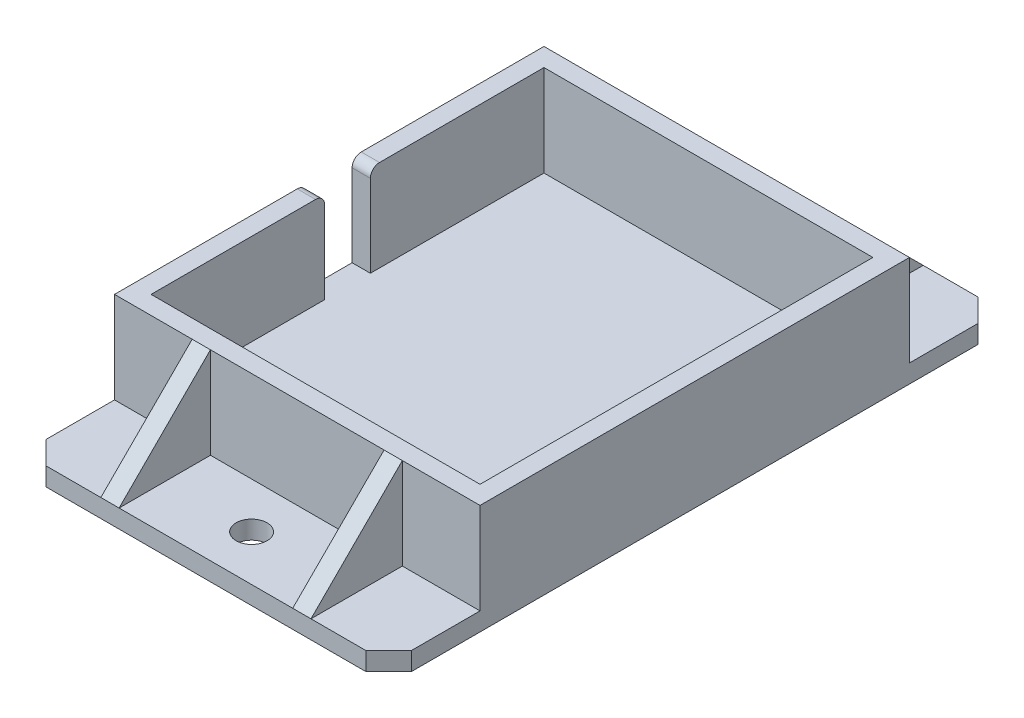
ISO-10303-21;
HEADER;
FILE_DESCRIPTION(('STEP AP214'),'2;1');
FILE_NAME('part.step','',(''),(''),'','','');
FILE_SCHEMA(('AUTOMOTIVE_DESIGN { 1 0 10303 214 1 1 1 1 }'));
ENDSEC;
DATA;
#1=APPLICATION_CONTEXT('core data for automotive mechanical design processes');
#2=APPLICATION_PROTOCOL_DEFINITION('international standard','automotive_design',2000,#1);
#3=PRODUCT_CONTEXT('',#1,'mechanical');
#4=PRODUCT('Part','Part','',(#3));
#5=PRODUCT_RELATED_PRODUCT_CATEGORY('part','',(#4));
#6=PRODUCT_DEFINITION_FORMATION('','',#4);
#7=PRODUCT_DEFINITION_CONTEXT('part definition',#1,'design');
#8=PRODUCT_DEFINITION('design','',#6,#7);
#9=PRODUCT_DEFINITION_SHAPE('','',#8);
#10=(LENGTH_UNIT() NAMED_UNIT(*) SI_UNIT(.MILLI.,.METRE.));
#11=(NAMED_UNIT(*) PLANE_ANGLE_UNIT() SI_UNIT($,.RADIAN.));
#12=(NAMED_UNIT(*) SI_UNIT($,.STERADIAN.) SOLID_ANGLE_UNIT());
#13=UNCERTAINTY_MEASURE_WITH_UNIT(LENGTH_MEASURE(1.E-05),#10,'distance_accuracy_value','');
#14=(GEOMETRIC_REPRESENTATION_CONTEXT(3) GLOBAL_UNCERTAINTY_ASSIGNED_CONTEXT((#13)) GLOBAL_UNIT_ASSIGNED_CONTEXT((#10,
#11,#12)) REPRESENTATION_CONTEXT('',''));
#15=CARTESIAN_POINT('',(0.,0.,0.));
#16=DIRECTION('',(0.,0.,1.));
#17=DIRECTION('',(1.,0.,0.));
#18=AXIS2_PLACEMENT_3D('',#15,#16,#17);
#19=CARTESIAN_POINT('',(-40.,20.,47.));
#20=DIRECTION('',(0.,0.,-1.));
#21=DIRECTION('',(-1.,0.,0.));
#22=AXIS2_PLACEMENT_3D('',#19,#20,#21);
#23=PLANE('',#22);
#24=DIRECTION('',(0.,-1.,0.));
#25=VECTOR('',#24,1.);
#26=CARTESIAN_POINT('',(19.,20.,47.));
#27=LINE('',#26,#25);
#28=CARTESIAN_POINT('',(19.,20.,47.));
#29=VERTEX_POINT('',#28);
#30=CARTESIAN_POINT('',(19.,0.,47.));
#31=VERTEX_POINT('',#30);
#32=EDGE_CURVE('E279',#29,#31,#27,.T.);
#33=ORIENTED_EDGE('',*,*,#32,.F.);
#34=DIRECTION('',(1.,0.,0.));
#35=VECTOR('',#34,1.);
#36=CARTESIAN_POINT('',(-40.,20.,47.));
#37=LINE('',#36,#35);
#38=CARTESIAN_POINT('',(-19.,20.,47.));
#39=VERTEX_POINT('',#38);
#40=EDGE_CURVE('E289',#39,#29,#37,.T.);
#41=ORIENTED_EDGE('',*,*,#40,.F.);
#42=DIRECTION('',(0.,1.,0.));
#43=VECTOR('',#42,1.);
#44=CARTESIAN_POINT('',(-19.,20.,47.));
#45=LINE('',#44,#43);
#46=CARTESIAN_POINT('',(-19.,0.,47.));
#47=VERTEX_POINT('',#46);
#48=EDGE_CURVE('E701',#47,#39,#45,.T.);
#49=ORIENTED_EDGE('',*,*,#48,.F.);
#50=DIRECTION('',(1.,0.,0.));
#51=VECTOR('',#50,1.);
#52=CARTESIAN_POINT('',(-40.,0.,47.));
#53=LINE('',#52,#51);
#54=EDGE_CURVE('E292',#47,#31,#53,.T.);
#55=ORIENTED_EDGE('',*,*,#54,.T.);
#56=EDGE_LOOP('',(#33,#41,#49,#55));
#57=FACE_BOUND('',#56,.T.);
#58=ADVANCED_FACE('F39',(#57),#23,.F.);
#59=CARTESIAN_POINT('',(0.,0.,0.));
#60=DIRECTION('',(0.,1.,0.));
#61=DIRECTION('',(0.,0.,1.));
#62=AXIS2_PLACEMENT_3D('',#59,#60,#61);
#63=PLANE('',#62);
#64=CARTESIAN_POINT('',(0.,0.,57.));
#65=DIRECTION('',(0.,1.,0.));
#66=DIRECTION('',(0.,0.,1.));
#67=AXIS2_PLACEMENT_3D('',#64,#65,#66);
#68=CIRCLE('',#67,3.4);
#69=CARTESIAN_POINT('',(0.,0.,60.4));
#70=VERTEX_POINT('',#69);
#71=EDGE_CURVE('E596',#70,#70,#68,.T.);
#72=ORIENTED_EDGE('',*,*,#71,.F.);
#73=EDGE_LOOP('',(#72));
#74=FACE_BOUND('',#73,.T.);
#75=DIRECTION('',(-1.,0.,0.));
#76=VECTOR('',#75,1.);
#77=CARTESIAN_POINT('',(-40.,0.,67.));
#78=LINE('',#77,#76);
#79=CARTESIAN_POINT('',(19.,0.,67.));
#80=VERTEX_POINT('',#79);
#81=CARTESIAN_POINT('',(-19.,0.,67.));
#82=VERTEX_POINT('',#81);
#83=EDGE_CURVE('E465',#80,#82,#78,.T.);
#84=ORIENTED_EDGE('',*,*,#83,.F.);
#85=DIRECTION('',(0.,0.,-1.));
#86=VECTOR('',#85,1.);
#87=CARTESIAN_POINT('',(19.,0.,0.));
#88=LINE('',#87,#86);
#89=EDGE_CURVE('E281',#80,#31,#88,.T.);
#90=ORIENTED_EDGE('',*,*,#89,.T.);
#91=ORIENTED_EDGE('',*,*,#54,.F.);
#92=DIRECTION('',(0.,0.,1.));
#93=VECTOR('',#92,1.);
#94=CARTESIAN_POINT('',(-19.,0.,0.));
#95=LINE('',#94,#93);
#96=EDGE_CURVE('E706',#47,#82,#95,.T.);
#97=ORIENTED_EDGE('',*,*,#96,.T.);
#98=EDGE_LOOP('',(#84,#90,#91,#97));
#99=FACE_BOUND('',#98,.T.);
#100=ADVANCED_FACE('F668',(#74,#99),#63,.T.);
#101=CARTESIAN_POINT('',(23.,20.,47.));
#102=VERTEX_POINT('',#101);
#103=CARTESIAN_POINT('',(40.,20.,47.));
#104=VERTEX_POINT('',#103);
#105=EDGE_CURVE('E302',#102,#104,#37,.T.);
#106=ORIENTED_EDGE('',*,*,#105,.F.);
#107=DIRECTION('',(0.,-1.,0.));
#108=VECTOR('',#107,1.);
#109=CARTESIAN_POINT('',(23.,20.,47.));
#110=LINE('',#109,#108);
#111=CARTESIAN_POINT('',(23.,0.,47.));
#112=VERTEX_POINT('',#111);
#113=EDGE_CURVE('E274',#102,#112,#110,.T.);
#114=ORIENTED_EDGE('',*,*,#113,.T.);
#115=CARTESIAN_POINT('',(40.,0.,47.));
#116=VERTEX_POINT('',#115);
#117=EDGE_CURVE('E325',#112,#116,#53,.T.);
#118=ORIENTED_EDGE('',*,*,#117,.T.);
#119=DIRECTION('',(0.,-1.,0.));
#120=VECTOR('',#119,1.);
#121=CARTESIAN_POINT('',(40.,20.,47.));
#122=LINE('',#121,#120);
#123=EDGE_CURVE('E339',#104,#116,#122,.T.);
#124=ORIENTED_EDGE('',*,*,#123,.F.);
#125=EDGE_LOOP('',(#106,#114,#118,#124));
#126=FACE_BOUND('',#125,.T.);
#127=ADVANCED_FACE('F670',(#126),#23,.F.);
#128=CARTESIAN_POINT('',(35.,0.,67.));
#129=VERTEX_POINT('',#128);
#130=CARTESIAN_POINT('',(23.,0.,67.));
#131=VERTEX_POINT('',#130);
#132=EDGE_CURVE('E461',#129,#131,#78,.T.);
#133=ORIENTED_EDGE('',*,*,#132,.F.);
#134=DIRECTION('',(-0.707106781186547,0.,0.707106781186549));
#135=VECTOR('',#134,1.);
#136=CARTESIAN_POINT('',(51.0000000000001,0.,50.9999999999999));
#137=LINE('',#136,#135);
#138=CARTESIAN_POINT('',(40.,0.,62.));
#139=VERTEX_POINT('',#138);
#140=EDGE_CURVE('E380',#129,#139,#137,.F.);
#141=ORIENTED_EDGE('',*,*,#140,.T.);
#142=DIRECTION('',(0.,0.,1.));
#143=VECTOR('',#142,1.);
#144=CARTESIAN_POINT('',(40.,0.,-67.));
#145=LINE('',#144,#143);
#146=EDGE_CURVE('E451',#116,#139,#145,.T.);
#147=ORIENTED_EDGE('',*,*,#146,.F.);
#148=ORIENTED_EDGE('',*,*,#117,.F.);
#149=DIRECTION('',(0.,0.,-1.));
#150=VECTOR('',#149,1.);
#151=CARTESIAN_POINT('',(23.,0.,0.));
#152=LINE('',#151,#150);
#153=EDGE_CURVE('E294',#131,#112,#152,.T.);
#154=ORIENTED_EDGE('',*,*,#153,.F.);
#155=EDGE_LOOP('',(#133,#141,#147,#148,#154));
#156=FACE_BOUND('',#155,.T.);
#157=ADVANCED_FACE('F677',(#156),#63,.T.);
#158=CARTESIAN_POINT('',(-40.,20.,-47.));
#159=DIRECTION('',(0.,0.,1.));
#160=DIRECTION('',(1.,0.,0.));
#161=AXIS2_PLACEMENT_3D('',#158,#159,#160);
#162=PLANE('',#161);
#163=DIRECTION('',(0.,1.,0.));
#164=VECTOR('',#163,1.);
#165=CARTESIAN_POINT('',(19.,20.,-47.));
#166=LINE('',#165,#164);
#167=CARTESIAN_POINT('',(19.,0.,-47.));
#168=VERTEX_POINT('',#167);
#169=CARTESIAN_POINT('',(19.,20.,-47.));
#170=VERTEX_POINT('',#169);
#171=EDGE_CURVE('E724',#168,#170,#166,.T.);
#172=ORIENTED_EDGE('',*,*,#171,.F.);
#173=DIRECTION('',(-1.,0.,0.));
#174=VECTOR('',#173,1.);
#175=CARTESIAN_POINT('',(-40.,0.,-47.));
#176=LINE('',#175,#174);
#177=CARTESIAN_POINT('',(-19.,0.,-47.));
#178=VERTEX_POINT('',#177);
#179=EDGE_CURVE('E331',#168,#178,#176,.T.);
#180=ORIENTED_EDGE('',*,*,#179,.T.);
#181=DIRECTION('',(0.,-1.,0.));
#182=VECTOR('',#181,1.);
#183=CARTESIAN_POINT('',(-19.,20.,-47.));
#184=LINE('',#183,#182);
#185=CARTESIAN_POINT('',(-19.,20.,-47.));
#186=VERTEX_POINT('',#185);
#187=EDGE_CURVE('E583',#186,#178,#184,.T.);
#188=ORIENTED_EDGE('',*,*,#187,.F.);
#189=DIRECTION('',(-1.,0.,0.));
#190=VECTOR('',#189,1.);
#191=CARTESIAN_POINT('',(-40.,20.,-47.));
#192=LINE('',#191,#190);
#193=EDGE_CURVE('E319',#170,#186,#192,.T.);
#194=ORIENTED_EDGE('',*,*,#193,.F.);
#195=EDGE_LOOP('',(#172,#180,#188,#194));
#196=FACE_BOUND('',#195,.T.);
#197=ADVANCED_FACE('F761',(#196),#162,.F.);
#198=CARTESIAN_POINT('',(0.,0.,-57.));
#199=DIRECTION('',(0.,1.,0.));
#200=DIRECTION('',(0.,0.,1.));
#201=AXIS2_PLACEMENT_3D('',#198,#199,#200);
#202=CIRCLE('',#201,3.4);
#203=CARTESIAN_POINT('',(0.,0.,-53.6));
#204=VERTEX_POINT('',#203);
#205=EDGE_CURVE('E604',#204,#204,#202,.T.);
#206=ORIENTED_EDGE('',*,*,#205,.F.);
#207=EDGE_LOOP('',(#206));
#208=FACE_BOUND('',#207,.T.);
#209=ORIENTED_EDGE('',*,*,#179,.F.);
#210=DIRECTION('',(0.,0.,-1.));
#211=VECTOR('',#210,1.);
#212=CARTESIAN_POINT('',(19.,0.,0.));
#213=LINE('',#212,#211);
#214=CARTESIAN_POINT('',(19.,0.,-67.));
#215=VERTEX_POINT('',#214);
#216=EDGE_CURVE('E717',#168,#215,#213,.T.);
#217=ORIENTED_EDGE('',*,*,#216,.T.);
#218=DIRECTION('',(1.,0.,0.));
#219=VECTOR('',#218,1.);
#220=CARTESIAN_POINT('',(-40.,0.,-67.));
#221=LINE('',#220,#219);
#222=CARTESIAN_POINT('',(-19.,0.,-67.));
#223=VERTEX_POINT('',#222);
#224=EDGE_CURVE('E754',#223,#215,#221,.T.);
#225=ORIENTED_EDGE('',*,*,#224,.F.);
#226=DIRECTION('',(0.,0.,1.));
#227=VECTOR('',#226,1.);
#228=CARTESIAN_POINT('',(-19.,0.,0.));
#229=LINE('',#228,#227);
#230=EDGE_CURVE('E590',#223,#178,#229,.T.);
#231=ORIENTED_EDGE('',*,*,#230,.T.);
#232=EDGE_LOOP('',(#209,#217,#225,#231));
#233=FACE_BOUND('',#232,.T.);
#234=ADVANCED_FACE('F752',(#208,#233),#63,.T.);
#235=CARTESIAN_POINT('',(40.,0.,-47.));
#236=VERTEX_POINT('',#235);
#237=CARTESIAN_POINT('',(23.,0.,-47.));
#238=VERTEX_POINT('',#237);
#239=EDGE_CURVE('E326',#236,#238,#176,.T.);
#240=ORIENTED_EDGE('',*,*,#239,.T.);
#241=DIRECTION('',(0.,1.,0.));
#242=VECTOR('',#241,1.);
#243=CARTESIAN_POINT('',(23.,20.,-47.));
#244=LINE('',#243,#242);
#245=CARTESIAN_POINT('',(23.,20.,-47.));
#246=VERTEX_POINT('',#245);
#247=EDGE_CURVE('E731',#238,#246,#244,.T.);
#248=ORIENTED_EDGE('',*,*,#247,.T.);
#249=CARTESIAN_POINT('',(40.,20.,-47.));
#250=VERTEX_POINT('',#249);
#251=EDGE_CURVE('E314',#250,#246,#192,.T.);
#252=ORIENTED_EDGE('',*,*,#251,.F.);
#253=DIRECTION('',(0.,-1.,0.));
#254=VECTOR('',#253,1.);
#255=CARTESIAN_POINT('',(40.,20.,-47.));
#256=LINE('',#255,#254);
#257=EDGE_CURVE('E335',#250,#236,#256,.T.);
#258=ORIENTED_EDGE('',*,*,#257,.T.);
#259=EDGE_LOOP('',(#240,#248,#252,#258));
#260=FACE_BOUND('',#259,.T.);
#261=ADVANCED_FACE('F812',(#260),#162,.F.);
#262=CARTESIAN_POINT('',(40.,0.,-62.));
#263=VERTEX_POINT('',#262);
#264=EDGE_CURVE('E444',#263,#236,#145,.T.);
#265=ORIENTED_EDGE('',*,*,#264,.F.);
#266=DIRECTION('',(0.707106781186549,0.,0.707106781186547));
#267=VECTOR('',#266,1.);
#268=CARTESIAN_POINT('',(51.,0.,-51.0000000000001));
#269=LINE('',#268,#267);
#270=CARTESIAN_POINT('',(35.,0.,-67.));
#271=VERTEX_POINT('',#270);
#272=EDGE_CURVE('E61',#263,#271,#269,.F.);
#273=ORIENTED_EDGE('',*,*,#272,.T.);
#274=CARTESIAN_POINT('',(23.,0.,-67.));
#275=VERTEX_POINT('',#274);
#276=EDGE_CURVE('E424',#275,#271,#221,.T.);
#277=ORIENTED_EDGE('',*,*,#276,.F.);
#278=DIRECTION('',(0.,0.,-1.));
#279=VECTOR('',#278,1.);
#280=CARTESIAN_POINT('',(23.,0.,0.));
#281=LINE('',#280,#279);
#282=EDGE_CURVE('E727',#238,#275,#281,.T.);
#283=ORIENTED_EDGE('',*,*,#282,.F.);
#284=ORIENTED_EDGE('',*,*,#239,.F.);
#285=EDGE_LOOP('',(#265,#273,#277,#283,#284));
#286=FACE_BOUND('',#285,.T.);
#287=ADVANCED_FACE('F447',(#286),#63,.T.);
#288=CARTESIAN_POINT('',(-36.,20.,-43.));
#289=DIRECTION('',(1.,0.,0.));
#290=DIRECTION('',(0.,0.,-1.));
#291=AXIS2_PLACEMENT_3D('',#288,#289,#290);
#292=PLANE('',#291);
#293=DIRECTION('',(0.,0.,1.));
#294=VECTOR('',#293,1.);
#295=CARTESIAN_POINT('',(-36.,20.,-43.));
#296=LINE('',#295,#294);
#297=CARTESIAN_POINT('',(-36.,20.,-43.));
#298=VERTEX_POINT('',#297);
#299=CARTESIAN_POINT('',(-36.,20.,-6.99999999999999));
#300=VERTEX_POINT('',#299);
#301=EDGE_CURVE('E481',#298,#300,#296,.T.);
#302=ORIENTED_EDGE('',*,*,#301,.T.);
#303=CARTESIAN_POINT('',(-36.,18.,-6.99999999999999));
#304=DIRECTION('',(1.,0.,0.));
#305=DIRECTION('',(0.,0.,-1.));
#306=AXIS2_PLACEMENT_3D('',#303,#304,#305);
#307=CIRCLE('',#306,2.);
#308=CARTESIAN_POINT('',(-36.,18.,-4.99999999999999));
#309=VERTEX_POINT('',#308);
#310=EDGE_CURVE('E364',#300,#309,#307,.T.);
#311=ORIENTED_EDGE('',*,*,#310,.T.);
#312=DIRECTION('',(0.,-1.,0.));
#313=VECTOR('',#312,1.);
#314=CARTESIAN_POINT('',(-36.,0.,-4.99999999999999));
#315=LINE('',#314,#313);
#316=CARTESIAN_POINT('',(-36.,0.,-4.99999999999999));
#317=VERTEX_POINT('',#316);
#318=EDGE_CURVE('E459',#309,#317,#315,.T.);
#319=ORIENTED_EDGE('',*,*,#318,.T.);
#320=DIRECTION('',(0.,0.,1.));
#321=VECTOR('',#320,1.);
#322=CARTESIAN_POINT('',(-36.,0.,-43.));
#323=LINE('',#322,#321);
#324=CARTESIAN_POINT('',(-36.,0.,-43.));
#325=VERTEX_POINT('',#324);
#326=EDGE_CURVE('E496',#325,#317,#323,.T.);
#327=ORIENTED_EDGE('',*,*,#326,.F.);
#328=DIRECTION('',(0.,-1.,0.));
#329=VECTOR('',#328,1.);
#330=CARTESIAN_POINT('',(-36.,20.,-43.));
#331=LINE('',#330,#329);
#332=EDGE_CURVE('E509',#298,#325,#331,.T.);
#333=ORIENTED_EDGE('',*,*,#332,.F.);
#334=EDGE_LOOP('',(#302,#311,#319,#327,#333));
#335=FACE_BOUND('',#334,.T.);
#336=ADVANCED_FACE('F543',(#335),#292,.T.);
#337=CARTESIAN_POINT('',(0.,20.,0.));
#338=DIRECTION('',(0.,1.,0.));
#339=DIRECTION('',(0.,0.,1.));
#340=AXIS2_PLACEMENT_3D('',#337,#338,#339);
#341=PLANE('',#340);
#342=DIRECTION('',(0.,0.,-1.));
#343=VECTOR('',#342,1.);
#344=CARTESIAN_POINT('',(36.,20.,-43.));
#345=LINE('',#344,#343);
#346=CARTESIAN_POINT('',(36.,20.,43.));
#347=VERTEX_POINT('',#346);
#348=CARTESIAN_POINT('',(36.,20.,-43.));
#349=VERTEX_POINT('',#348);
#350=EDGE_CURVE('E473',#347,#349,#345,.T.);
#351=ORIENTED_EDGE('',*,*,#350,.F.);
#352=DIRECTION('',(1.,0.,0.));
#353=VECTOR('',#352,1.);
#354=CARTESIAN_POINT('',(-36.,20.,43.));
#355=LINE('',#354,#353);
#356=CARTESIAN_POINT('',(-36.,20.,43.));
#357=VERTEX_POINT('',#356);
#358=EDGE_CURVE('E485',#357,#347,#355,.T.);
#359=ORIENTED_EDGE('',*,*,#358,.F.);
#360=CARTESIAN_POINT('',(-36.,20.,7.00000000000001));
#361=VERTEX_POINT('',#360);
#362=EDGE_CURVE('E480',#361,#357,#296,.T.);
#363=ORIENTED_EDGE('',*,*,#362,.F.);
#364=DIRECTION('',(-1.,0.,0.));
#365=VECTOR('',#364,1.);
#366=CARTESIAN_POINT('',(-40.,20.,7.));
#367=LINE('',#366,#365);
#368=CARTESIAN_POINT('',(-40.,20.,7.00000000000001));
#369=VERTEX_POINT('',#368);
#370=EDGE_CURVE('E357',#361,#369,#367,.T.);
#371=ORIENTED_EDGE('',*,*,#370,.T.);
#372=DIRECTION('',(0.,0.,1.));
#373=VECTOR('',#372,1.);
#374=CARTESIAN_POINT('',(-40.,20.,-47.));
#375=LINE('',#374,#373);
#376=CARTESIAN_POINT('',(-40.,20.,47.));
#377=VERTEX_POINT('',#376);
#378=EDGE_CURVE('E330',#369,#377,#375,.T.);
#379=ORIENTED_EDGE('',*,*,#378,.T.);
#380=CARTESIAN_POINT('',(-23.,20.,47.));
#381=VERTEX_POINT('',#380);
#382=EDGE_CURVE('E301',#377,#381,#37,.T.);
#383=ORIENTED_EDGE('',*,*,#382,.T.);
#384=DIRECTION('',(1.,0.,0.));
#385=VECTOR('',#384,1.);
#386=CARTESIAN_POINT('',(-40.,20.,47.));
#387=LINE('',#386,#385);
#388=EDGE_CURVE('E299',#381,#39,#387,.T.);
#389=ORIENTED_EDGE('',*,*,#388,.T.);
#390=ORIENTED_EDGE('',*,*,#40,.T.);
#391=DIRECTION('',(-1.,0.,0.));
#392=VECTOR('',#391,1.);
#393=CARTESIAN_POINT('',(0.,20.,47.));
#394=LINE('',#393,#392);
#395=EDGE_CURVE('E261',#29,#102,#394,.F.);
#396=ORIENTED_EDGE('',*,*,#395,.T.);
#397=ORIENTED_EDGE('',*,*,#105,.T.);
#398=DIRECTION('',(0.,0.,-1.));
#399=VECTOR('',#398,1.);
#400=CARTESIAN_POINT('',(40.,20.,-47.));
#401=LINE('',#400,#399);
#402=EDGE_CURVE('E306',#104,#250,#401,.T.);
#403=ORIENTED_EDGE('',*,*,#402,.T.);
#404=ORIENTED_EDGE('',*,*,#251,.T.);
#405=DIRECTION('',(-1.,0.,0.));
#406=VECTOR('',#405,1.);
#407=CARTESIAN_POINT('',(0.,20.,-47.));
#408=LINE('',#407,#406);
#409=EDGE_CURVE('E735',#246,#170,#408,.T.);
#410=ORIENTED_EDGE('',*,*,#409,.T.);
#411=ORIENTED_EDGE('',*,*,#193,.T.);
#412=DIRECTION('',(1.,0.,0.));
#413=VECTOR('',#412,1.);
#414=CARTESIAN_POINT('',(-40.,20.,-47.));
#415=LINE('',#414,#413);
#416=CARTESIAN_POINT('',(-23.,20.,-47.));
#417=VERTEX_POINT('',#416);
#418=EDGE_CURVE('E587',#186,#417,#415,.F.);
#419=ORIENTED_EDGE('',*,*,#418,.T.);
#420=CARTESIAN_POINT('',(-40.,20.,-47.));
#421=VERTEX_POINT('',#420);
#422=EDGE_CURVE('E313',#417,#421,#192,.T.);
#423=ORIENTED_EDGE('',*,*,#422,.T.);
#424=CARTESIAN_POINT('',(-40.,20.,-6.99999999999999));
#425=VERTEX_POINT('',#424);
#426=EDGE_CURVE('E307',#421,#425,#375,.T.);
#427=ORIENTED_EDGE('',*,*,#426,.T.);
#428=DIRECTION('',(-1.,0.,0.));
#429=VECTOR('',#428,1.);
#430=CARTESIAN_POINT('',(-36.,20.,-6.99999999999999));
#431=LINE('',#430,#429);
#432=EDGE_CURVE('E361',#425,#300,#431,.F.);
#433=ORIENTED_EDGE('',*,*,#432,.T.);
#434=ORIENTED_EDGE('',*,*,#301,.F.);
#435=DIRECTION('',(-1.,0.,0.));
#436=VECTOR('',#435,1.);
#437=CARTESIAN_POINT('',(-36.,20.,-43.));
#438=LINE('',#437,#436);
#439=EDGE_CURVE('E476',#349,#298,#438,.T.);
#440=ORIENTED_EDGE('',*,*,#439,.F.);
#441=EDGE_LOOP('',(#351,#359,#363,#371,#379,#383,#389,#390,#396,#397,#403,#404,#410,#411,#419,
#423,#427,#433,#434,#440));
#442=FACE_BOUND('',#441,.T.);
#443=ADVANCED_FACE('F297',(#442),#341,.T.);
#444=CARTESIAN_POINT('',(-40.,20.,-47.));
#445=DIRECTION('',(1.,0.,0.));
#446=DIRECTION('',(0.,0.,-1.));
#447=AXIS2_PLACEMENT_3D('',#444,#445,#446);
#448=PLANE('',#447);
#449=DIRECTION('',(0.,0.,-1.));
#450=VECTOR('',#449,1.);
#451=CARTESIAN_POINT('',(-40.,-4.,-67.));
#452=LINE('',#451,#450);
#453=CARTESIAN_POINT('',(-40.,-4.,62.));
#454=VERTEX_POINT('',#453);
#455=CARTESIAN_POINT('',(-40.,-4.,-62.));
#456=VERTEX_POINT('',#455);
#457=EDGE_CURVE('E436',#454,#456,#452,.T.);
#458=ORIENTED_EDGE('',*,*,#457,.F.);
#459=DIRECTION('',(0.,1.,0.));
#460=VECTOR('',#459,1.);
#461=CARTESIAN_POINT('',(-40.,20.,62.));
#462=LINE('',#461,#460);
#463=CARTESIAN_POINT('',(-40.,0.,62.));
#464=VERTEX_POINT('',#463);
#465=EDGE_CURVE('E405',#454,#464,#462,.T.);
#466=ORIENTED_EDGE('',*,*,#465,.T.);
#467=DIRECTION('',(0.,0.,-1.));
#468=VECTOR('',#467,1.);
#469=CARTESIAN_POINT('',(-40.,0.,-67.));
#470=LINE('',#469,#468);
#471=CARTESIAN_POINT('',(-40.,0.,47.));
#472=VERTEX_POINT('',#471);
#473=EDGE_CURVE('E466',#464,#472,#470,.T.);
#474=ORIENTED_EDGE('',*,*,#473,.T.);
#475=DIRECTION('',(0.,-1.,0.));
#476=VECTOR('',#475,1.);
#477=CARTESIAN_POINT('',(-40.,20.,47.));
#478=LINE('',#477,#476);
#479=EDGE_CURVE('E343',#377,#472,#478,.T.);
#480=ORIENTED_EDGE('',*,*,#479,.F.);
#481=ORIENTED_EDGE('',*,*,#378,.F.);
#482=CARTESIAN_POINT('',(-40.,18.,7.));
#483=DIRECTION('',(1.,0.,0.));
#484=DIRECTION('',(0.,0.,-1.));
#485=AXIS2_PLACEMENT_3D('',#482,#483,#484);
#486=CIRCLE('',#485,2.);
#487=CARTESIAN_POINT('',(-40.,18.,5.));
#488=VERTEX_POINT('',#487);
#489=EDGE_CURVE('E351',#369,#488,#486,.F.);
#490=ORIENTED_EDGE('',*,*,#489,.T.);
#491=DIRECTION('',(0.,1.,0.));
#492=VECTOR('',#491,1.);
#493=CARTESIAN_POINT('',(-40.,20.,5.));
#494=LINE('',#493,#492);
#495=CARTESIAN_POINT('',(-40.,0.,5.00000000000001));
#496=VERTEX_POINT('',#495);
#497=EDGE_CURVE('E623',#496,#488,#494,.T.);
#498=ORIENTED_EDGE('',*,*,#497,.F.);
#499=DIRECTION('',(0.,0.,1.));
#500=VECTOR('',#499,1.);
#501=CARTESIAN_POINT('',(-40.,0.,5.00000000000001));
#502=LINE('',#501,#500);
#503=CARTESIAN_POINT('',(-40.,0.,-4.99999999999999));
#504=VERTEX_POINT('',#503);
#505=EDGE_CURVE('E619',#504,#496,#502,.T.);
#506=ORIENTED_EDGE('',*,*,#505,.F.);
#507=DIRECTION('',(0.,-1.,0.));
#508=VECTOR('',#507,1.);
#509=CARTESIAN_POINT('',(-40.,0.,-4.99999999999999));
#510=LINE('',#509,#508);
#511=CARTESIAN_POINT('',(-40.,18.,-4.99999999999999));
#512=VERTEX_POINT('',#511);
#513=EDGE_CURVE('E616',#512,#504,#510,.T.);
#514=ORIENTED_EDGE('',*,*,#513,.F.);
#515=CARTESIAN_POINT('',(-40.,18.,-6.99999999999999));
#516=DIRECTION('',(1.,0.,0.));
#517=DIRECTION('',(0.,0.,-1.));
#518=AXIS2_PLACEMENT_3D('',#515,#516,#517);
#519=CIRCLE('',#518,2.);
#520=EDGE_CURVE('E354',#512,#425,#519,.F.);
#521=ORIENTED_EDGE('',*,*,#520,.T.);
#522=ORIENTED_EDGE('',*,*,#426,.F.);
#523=DIRECTION('',(0.,-1.,0.));
#524=VECTOR('',#523,1.);
#525=CARTESIAN_POINT('',(-40.,20.,-47.));
#526=LINE('',#525,#524);
#527=CARTESIAN_POINT('',(-40.,0.,-47.));
#528=VERTEX_POINT('',#527);
#529=EDGE_CURVE('E318',#421,#528,#526,.T.);
#530=ORIENTED_EDGE('',*,*,#529,.T.);
#531=CARTESIAN_POINT('',(-40.,0.,-62.));
#532=VERTEX_POINT('',#531);
#533=EDGE_CURVE('E464',#528,#532,#470,.T.);
#534=ORIENTED_EDGE('',*,*,#533,.T.);
#535=DIRECTION('',(0.,-1.,0.));
#536=VECTOR('',#535,1.);
#537=CARTESIAN_POINT('',(-40.,20.,-62.));
#538=LINE('',#537,#536);
#539=EDGE_CURVE('E402',#532,#456,#538,.T.);
#540=ORIENTED_EDGE('',*,*,#539,.T.);
#541=EDGE_LOOP('',(#458,#466,#474,#480,#481,#490,#498,#506,#514,#521,#522,#530,#534,#540));
#542=FACE_BOUND('',#541,.T.);
#543=ADVANCED_FACE('F633',(#542),#448,.F.);
#544=CARTESIAN_POINT('',(-23.,0.,47.));
#545=VERTEX_POINT('',#544);
#546=EDGE_CURVE('E320',#472,#545,#53,.T.);
#547=ORIENTED_EDGE('',*,*,#546,.T.);
#548=DIRECTION('',(0.,1.,0.));
#549=VECTOR('',#548,1.);
#550=CARTESIAN_POINT('',(-23.,20.,47.));
#551=LINE('',#550,#549);
#552=EDGE_CURVE('E689',#545,#381,#551,.T.);
#553=ORIENTED_EDGE('',*,*,#552,.T.);
#554=ORIENTED_EDGE('',*,*,#382,.F.);
#555=ORIENTED_EDGE('',*,*,#479,.T.);
#556=EDGE_LOOP('',(#547,#553,#554,#555));
#557=FACE_BOUND('',#556,.T.);
#558=ADVANCED_FACE('F671',(#557),#23,.F.);
#559=CARTESIAN_POINT('',(40.,20.,-47.));
#560=DIRECTION('',(-1.,0.,0.));
#561=DIRECTION('',(0.,0.,1.));
#562=AXIS2_PLACEMENT_3D('',#559,#560,#561);
#563=PLANE('',#562);
#564=ORIENTED_EDGE('',*,*,#146,.T.);
#565=DIRECTION('',(0.,-1.,0.));
#566=VECTOR('',#565,1.);
#567=CARTESIAN_POINT('',(40.,20.,62.));
#568=LINE('',#567,#566);
#569=CARTESIAN_POINT('',(40.,-4.,62.));
#570=VERTEX_POINT('',#569);
#571=EDGE_CURVE('E387',#139,#570,#568,.T.);
#572=ORIENTED_EDGE('',*,*,#571,.T.);
#573=DIRECTION('',(0.,0.,1.));
#574=VECTOR('',#573,1.);
#575=CARTESIAN_POINT('',(40.,-4.,-67.));
#576=LINE('',#575,#574);
#577=CARTESIAN_POINT('',(40.,-4.,-62.));
#578=VERTEX_POINT('',#577);
#579=EDGE_CURVE('E446',#578,#570,#576,.T.);
#580=ORIENTED_EDGE('',*,*,#579,.F.);
#581=DIRECTION('',(0.,1.,0.));
#582=VECTOR('',#581,1.);
#583=CARTESIAN_POINT('',(40.,20.,-62.));
#584=LINE('',#583,#582);
#585=EDGE_CURVE('E383',#578,#263,#584,.T.);
#586=ORIENTED_EDGE('',*,*,#585,.T.);
#587=ORIENTED_EDGE('',*,*,#264,.T.);
#588=ORIENTED_EDGE('',*,*,#257,.F.);
#589=ORIENTED_EDGE('',*,*,#402,.F.);
#590=ORIENTED_EDGE('',*,*,#123,.T.);
#591=EDGE_LOOP('',(#564,#572,#580,#586,#587,#588,#589,#590));
#592=FACE_BOUND('',#591,.T.);
#593=ADVANCED_FACE('F442',(#592),#563,.F.);
#594=ORIENTED_EDGE('',*,*,#422,.F.);
#595=DIRECTION('',(0.,-1.,0.));
#596=VECTOR('',#595,1.);
#597=CARTESIAN_POINT('',(-23.,20.,-47.));
#598=LINE('',#597,#596);
#599=CARTESIAN_POINT('',(-23.,0.,-47.));
#600=VERTEX_POINT('',#599);
#601=EDGE_CURVE('E582',#417,#600,#598,.T.);
#602=ORIENTED_EDGE('',*,*,#601,.T.);
#603=EDGE_CURVE('E324',#600,#528,#176,.T.);
#604=ORIENTED_EDGE('',*,*,#603,.T.);
#605=ORIENTED_EDGE('',*,*,#529,.F.);
#606=EDGE_LOOP('',(#594,#602,#604,#605));
#607=FACE_BOUND('',#606,.T.);
#608=ADVANCED_FACE('F665',(#607),#162,.F.);
#609=CARTESIAN_POINT('',(36.,20.,-43.));
#610=DIRECTION('',(-1.,0.,0.));
#611=DIRECTION('',(0.,0.,1.));
#612=AXIS2_PLACEMENT_3D('',#609,#610,#611);
#613=PLANE('',#612);
#614=DIRECTION('',(0.,0.,-1.));
#615=VECTOR('',#614,1.);
#616=CARTESIAN_POINT('',(36.,0.,-43.));
#617=LINE('',#616,#615);
#618=CARTESIAN_POINT('',(36.,0.,43.));
#619=VERTEX_POINT('',#618);
#620=CARTESIAN_POINT('',(36.,0.,-43.));
#621=VERTEX_POINT('',#620);
#622=EDGE_CURVE('E435',#619,#621,#617,.T.);
#623=ORIENTED_EDGE('',*,*,#622,.F.);
#624=DIRECTION('',(0.,-1.,0.));
#625=VECTOR('',#624,1.);
#626=CARTESIAN_POINT('',(36.,20.,43.));
#627=LINE('',#626,#625);
#628=EDGE_CURVE('E488',#347,#619,#627,.T.);
#629=ORIENTED_EDGE('',*,*,#628,.F.);
#630=ORIENTED_EDGE('',*,*,#350,.T.);
#631=DIRECTION('',(0.,-1.,0.));
#632=VECTOR('',#631,1.);
#633=CARTESIAN_POINT('',(36.,20.,-43.));
#634=LINE('',#633,#632);
#635=EDGE_CURVE('E512',#349,#621,#634,.T.);
#636=ORIENTED_EDGE('',*,*,#635,.T.);
#637=EDGE_LOOP('',(#623,#629,#630,#636));
#638=FACE_BOUND('',#637,.T.);
#639=ADVANCED_FACE('F654',(#638),#613,.T.);
#640=CARTESIAN_POINT('',(-36.,20.,-43.));
#641=DIRECTION('',(0.,0.,1.));
#642=DIRECTION('',(1.,0.,0.));
#643=AXIS2_PLACEMENT_3D('',#640,#641,#642);
#644=PLANE('',#643);
#645=ORIENTED_EDGE('',*,*,#439,.T.);
#646=ORIENTED_EDGE('',*,*,#332,.T.);
#647=DIRECTION('',(-1.,0.,0.));
#648=VECTOR('',#647,1.);
#649=CARTESIAN_POINT('',(-36.,0.,-43.));
#650=LINE('',#649,#648);
#651=EDGE_CURVE('E492',#621,#325,#650,.T.);
#652=ORIENTED_EDGE('',*,*,#651,.F.);
#653=ORIENTED_EDGE('',*,*,#635,.F.);
#654=EDGE_LOOP('',(#645,#646,#652,#653));
#655=FACE_BOUND('',#654,.T.);
#656=ADVANCED_FACE('F656',(#655),#644,.T.);
#657=DIRECTION('',(0.,1.,0.));
#658=VECTOR('',#657,1.);
#659=CARTESIAN_POINT('',(-36.,20.,5.));
#660=LINE('',#659,#658);
#661=CARTESIAN_POINT('',(-36.,0.,5.00000000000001));
#662=VERTEX_POINT('',#661);
#663=CARTESIAN_POINT('',(-36.,18.,5.));
#664=VERTEX_POINT('',#663);
#665=EDGE_CURVE('E612',#662,#664,#660,.T.);
#666=ORIENTED_EDGE('',*,*,#665,.T.);
#667=CARTESIAN_POINT('',(-36.,18.,7.));
#668=DIRECTION('',(1.,0.,0.));
#669=DIRECTION('',(0.,0.,-1.));
#670=AXIS2_PLACEMENT_3D('',#667,#668,#669);
#671=CIRCLE('',#670,2.);
#672=EDGE_CURVE('E370',#664,#361,#671,.T.);
#673=ORIENTED_EDGE('',*,*,#672,.T.);
#674=ORIENTED_EDGE('',*,*,#362,.T.);
#675=DIRECTION('',(0.,-1.,0.));
#676=VECTOR('',#675,1.);
#677=CARTESIAN_POINT('',(-36.,20.,43.));
#678=LINE('',#677,#676);
#679=CARTESIAN_POINT('',(-36.,0.,43.));
#680=VERTEX_POINT('',#679);
#681=EDGE_CURVE('E505',#357,#680,#678,.T.);
#682=ORIENTED_EDGE('',*,*,#681,.T.);
#683=EDGE_CURVE('E495',#662,#680,#323,.T.);
#684=ORIENTED_EDGE('',*,*,#683,.F.);
#685=EDGE_LOOP('',(#666,#673,#674,#682,#684));
#686=FACE_BOUND('',#685,.T.);
#687=ADVANCED_FACE('F650',(#686),#292,.T.);
#688=CARTESIAN_POINT('',(-36.,20.,43.));
#689=DIRECTION('',(0.,0.,-1.));
#690=DIRECTION('',(-1.,0.,0.));
#691=AXIS2_PLACEMENT_3D('',#688,#689,#690);
#692=PLANE('',#691);
#693=ORIENTED_EDGE('',*,*,#628,.T.);
#694=DIRECTION('',(1.,0.,0.));
#695=VECTOR('',#694,1.);
#696=CARTESIAN_POINT('',(-36.,0.,43.));
#697=LINE('',#696,#695);
#698=EDGE_CURVE('E477',#680,#619,#697,.T.);
#699=ORIENTED_EDGE('',*,*,#698,.F.);
#700=ORIENTED_EDGE('',*,*,#681,.F.);
#701=ORIENTED_EDGE('',*,*,#358,.T.);
#702=EDGE_LOOP('',(#693,#699,#700,#701));
#703=FACE_BOUND('',#702,.T.);
#704=ADVANCED_FACE('F652',(#703),#692,.T.);
#705=ORIENTED_EDGE('',*,*,#651,.T.);
#706=ORIENTED_EDGE('',*,*,#326,.T.);
#707=DIRECTION('',(-1.,0.,0.));
#708=VECTOR('',#707,1.);
#709=CARTESIAN_POINT('',(40.001,0.,-5.));
#710=LINE('',#709,#708);
#711=EDGE_CURVE('E551',#317,#504,#710,.T.);
#712=ORIENTED_EDGE('',*,*,#711,.T.);
#713=ORIENTED_EDGE('',*,*,#505,.T.);
#714=DIRECTION('',(-1.,0.,0.));
#715=VECTOR('',#714,1.);
#716=CARTESIAN_POINT('',(40.001,0.,5.));
#717=LINE('',#716,#715);
#718=EDGE_CURVE('E553',#662,#496,#717,.T.);
#719=ORIENTED_EDGE('',*,*,#718,.F.);
#720=ORIENTED_EDGE('',*,*,#683,.T.);
#721=ORIENTED_EDGE('',*,*,#698,.T.);
#722=ORIENTED_EDGE('',*,*,#622,.T.);
#723=EDGE_LOOP('',(#705,#706,#712,#713,#719,#720,#721,#722));
#724=FACE_BOUND('',#723,.T.);
#725=ADVANCED_FACE('F632',(#724),#63,.T.);
#726=CARTESIAN_POINT('',(-35.,0.,-67.));
#727=VERTEX_POINT('',#726);
#728=CARTESIAN_POINT('',(-23.,0.,-67.));
#729=VERTEX_POINT('',#728);
#730=EDGE_CURVE('E469',#727,#729,#221,.T.);
#731=ORIENTED_EDGE('',*,*,#730,.F.);
#732=DIRECTION('',(0.707106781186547,0.,-0.707106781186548));
#733=VECTOR('',#732,1.);
#734=CARTESIAN_POINT('',(-51.,0.,-51.));
#735=LINE('',#734,#733);
#736=EDGE_CURVE('E11',#727,#532,#735,.F.);
#737=ORIENTED_EDGE('',*,*,#736,.T.);
#738=ORIENTED_EDGE('',*,*,#533,.F.);
#739=ORIENTED_EDGE('',*,*,#603,.F.);
#740=DIRECTION('',(0.,0.,1.));
#741=VECTOR('',#740,1.);
#742=CARTESIAN_POINT('',(-23.,0.,0.));
#743=LINE('',#742,#741);
#744=EDGE_CURVE('E577',#729,#600,#743,.T.);
#745=ORIENTED_EDGE('',*,*,#744,.F.);
#746=EDGE_LOOP('',(#731,#737,#738,#739,#745));
#747=FACE_BOUND('',#746,.T.);
#748=ADVANCED_FACE('F573',(#747),#63,.T.);
#749=ORIENTED_EDGE('',*,*,#473,.F.);
#750=DIRECTION('',(-0.707106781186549,0.,-0.707106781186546));
#751=VECTOR('',#750,1.);
#752=CARTESIAN_POINT('',(-50.9999999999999,0.,51.0000000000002));
#753=LINE('',#752,#751);
#754=CARTESIAN_POINT('',(-35.,0.,67.));
#755=VERTEX_POINT('',#754);
#756=EDGE_CURVE('E409',#464,#755,#753,.F.);
#757=ORIENTED_EDGE('',*,*,#756,.T.);
#758=CARTESIAN_POINT('',(-23.,0.,67.));
#759=VERTEX_POINT('',#758);
#760=EDGE_CURVE('E450',#759,#755,#78,.T.);
#761=ORIENTED_EDGE('',*,*,#760,.F.);
#762=DIRECTION('',(0.,0.,1.));
#763=VECTOR('',#762,1.);
#764=CARTESIAN_POINT('',(-23.,0.,0.));
#765=LINE('',#764,#763);
#766=EDGE_CURVE('E696',#545,#759,#765,.T.);
#767=ORIENTED_EDGE('',*,*,#766,.F.);
#768=ORIENTED_EDGE('',*,*,#546,.F.);
#769=EDGE_LOOP('',(#749,#757,#761,#767,#768));
#770=FACE_BOUND('',#769,.T.);
#771=ADVANCED_FACE('F693',(#770),#63,.T.);
#772=CARTESIAN_POINT('',(-40.,-4.,67.));
#773=DIRECTION('',(0.,0.,-1.));
#774=DIRECTION('',(-1.,0.,0.));
#775=AXIS2_PLACEMENT_3D('',#772,#773,#774);
#776=PLANE('',#775);
#777=DIRECTION('',(-1.,0.,0.));
#778=VECTOR('',#777,1.);
#779=CARTESIAN_POINT('',(-40.,-4.,67.));
#780=LINE('',#779,#778);
#781=CARTESIAN_POINT('',(35.,-4.,67.));
#782=VERTEX_POINT('',#781);
#783=CARTESIAN_POINT('',(-35.,-4.,67.));
#784=VERTEX_POINT('',#783);
#785=EDGE_CURVE('E561',#782,#784,#780,.T.);
#786=ORIENTED_EDGE('',*,*,#785,.F.);
#787=DIRECTION('',(0.,1.,0.));
#788=VECTOR('',#787,1.);
#789=CARTESIAN_POINT('',(35.,-4.,67.));
#790=LINE('',#789,#788);
#791=EDGE_CURVE('E376',#782,#129,#790,.T.);
#792=ORIENTED_EDGE('',*,*,#791,.T.);
#793=ORIENTED_EDGE('',*,*,#132,.T.);
#794=EDGE_CURVE('E458',#131,#80,#78,.T.);
#795=ORIENTED_EDGE('',*,*,#794,.T.);
#796=ORIENTED_EDGE('',*,*,#83,.T.);
#797=EDGE_CURVE('E456',#82,#759,#78,.T.);
#798=ORIENTED_EDGE('',*,*,#797,.T.);
#799=ORIENTED_EDGE('',*,*,#760,.T.);
#800=DIRECTION('',(0.,-1.,0.));
#801=VECTOR('',#800,1.);
#802=CARTESIAN_POINT('',(-35.,-4.,67.));
#803=LINE('',#802,#801);
#804=EDGE_CURVE('E373',#755,#784,#803,.T.);
#805=ORIENTED_EDGE('',*,*,#804,.T.);
#806=EDGE_LOOP('',(#786,#792,#793,#795,#796,#798,#799,#805));
#807=FACE_BOUND('',#806,.T.);
#808=ADVANCED_FACE('F779',(#807),#776,.F.);
#809=CARTESIAN_POINT('',(-40.,-4.,-67.));
#810=DIRECTION('',(0.,0.,1.));
#811=DIRECTION('',(1.,0.,0.));
#812=AXIS2_PLACEMENT_3D('',#809,#810,#811);
#813=PLANE('',#812);
#814=ORIENTED_EDGE('',*,*,#276,.T.);
#815=DIRECTION('',(0.,-1.,0.));
#816=VECTOR('',#815,1.);
#817=CARTESIAN_POINT('',(35.,-4.,-67.));
#818=LINE('',#817,#816);
#819=CARTESIAN_POINT('',(35.,-4.,-67.));
#820=VERTEX_POINT('',#819);
#821=EDGE_CURVE('E48',#271,#820,#818,.T.);
#822=ORIENTED_EDGE('',*,*,#821,.T.);
#823=DIRECTION('',(1.,0.,0.));
#824=VECTOR('',#823,1.);
#825=CARTESIAN_POINT('',(-40.,-4.,-67.));
#826=LINE('',#825,#824);
#827=CARTESIAN_POINT('',(-35.,-4.,-67.));
#828=VERTEX_POINT('',#827);
#829=EDGE_CURVE('E422',#828,#820,#826,.T.);
#830=ORIENTED_EDGE('',*,*,#829,.F.);
#831=DIRECTION('',(0.,1.,0.));
#832=VECTOR('',#831,1.);
#833=CARTESIAN_POINT('',(-35.,-4.,-67.));
#834=LINE('',#833,#832);
#835=EDGE_CURVE('E414',#828,#727,#834,.T.);
#836=ORIENTED_EDGE('',*,*,#835,.T.);
#837=ORIENTED_EDGE('',*,*,#730,.T.);
#838=EDGE_CURVE('E472',#729,#223,#221,.T.);
#839=ORIENTED_EDGE('',*,*,#838,.T.);
#840=ORIENTED_EDGE('',*,*,#224,.T.);
#841=EDGE_CURVE('E767',#215,#275,#221,.T.);
#842=ORIENTED_EDGE('',*,*,#841,.T.);
#843=EDGE_LOOP('',(#814,#822,#830,#836,#837,#839,#840,#842));
#844=FACE_BOUND('',#843,.T.);
#845=ADVANCED_FACE('F421',(#844),#813,.F.);
#846=CARTESIAN_POINT('',(0.,-4.,0.));
#847=DIRECTION('',(0.,1.,0.));
#848=DIRECTION('',(0.,0.,1.));
#849=AXIS2_PLACEMENT_3D('',#846,#847,#848);
#850=PLANE('',#849);
#851=ORIENTED_EDGE('',*,*,#579,.T.);
#852=DIRECTION('',(0.707106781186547,0.,-0.707106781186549));
#853=VECTOR('',#852,1.);
#854=CARTESIAN_POINT('',(35.,-4.,67.));
#855=LINE('',#854,#853);
#856=EDGE_CURVE('E399',#570,#782,#855,.F.);
#857=ORIENTED_EDGE('',*,*,#856,.T.);
#858=ORIENTED_EDGE('',*,*,#785,.T.);
#859=DIRECTION('',(0.707106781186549,0.,0.707106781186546));
#860=VECTOR('',#859,1.);
#861=CARTESIAN_POINT('',(-40.,-4.,62.));
#862=LINE('',#861,#860);
#863=EDGE_CURVE('E396',#784,#454,#862,.F.);
#864=ORIENTED_EDGE('',*,*,#863,.T.);
#865=ORIENTED_EDGE('',*,*,#457,.T.);
#866=DIRECTION('',(-0.707106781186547,0.,0.707106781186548));
#867=VECTOR('',#866,1.);
#868=CARTESIAN_POINT('',(-35.,-4.,-67.));
#869=LINE('',#868,#867);
#870=EDGE_CURVE('E390',#456,#828,#869,.F.);
#871=ORIENTED_EDGE('',*,*,#870,.T.);
#872=ORIENTED_EDGE('',*,*,#829,.T.);
#873=DIRECTION('',(-0.707106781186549,0.,-0.707106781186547));
#874=VECTOR('',#873,1.);
#875=CARTESIAN_POINT('',(40.,-4.,-62.));
#876=LINE('',#875,#874);
#877=EDGE_CURVE('E393',#820,#578,#876,.F.);
#878=ORIENTED_EDGE('',*,*,#877,.T.);
#879=EDGE_LOOP('',(#851,#857,#858,#864,#865,#871,#872,#878));
#880=FACE_BOUND('',#879,.T.);
#881=CARTESIAN_POINT('',(0.,-4.,57.));
#882=DIRECTION('',(0.,1.,0.));
#883=DIRECTION('',(0.,0.,1.));
#884=AXIS2_PLACEMENT_3D('',#881,#882,#883);
#885=CIRCLE('',#884,3.4);
#886=CARTESIAN_POINT('',(0.,-4.,60.4));
#887=VERTEX_POINT('',#886);
#888=EDGE_CURVE('E600',#887,#887,#885,.T.);
#889=ORIENTED_EDGE('',*,*,#888,.T.);
#890=EDGE_LOOP('',(#889));
#891=FACE_BOUND('',#890,.T.);
#892=CARTESIAN_POINT('',(0.,-4.,-57.));
#893=DIRECTION('',(0.,1.,0.));
#894=DIRECTION('',(0.,0.,1.));
#895=AXIS2_PLACEMENT_3D('',#892,#893,#894);
#896=CIRCLE('',#895,3.4);
#897=CARTESIAN_POINT('',(0.,-4.,-53.6));
#898=VERTEX_POINT('',#897);
#899=EDGE_CURVE('E608',#898,#898,#896,.T.);
#900=ORIENTED_EDGE('',*,*,#899,.T.);
#901=EDGE_LOOP('',(#900));
#902=FACE_BOUND('',#901,.T.);
#903=ADVANCED_FACE('F429',(#880,#891,#902),#850,.F.);
#904=CARTESIAN_POINT('',(40.001,0.,-5.));
#905=DIRECTION('',(0.,0.,-1.));
#906=DIRECTION('',(-1.,0.,0.));
#907=AXIS2_PLACEMENT_3D('',#904,#905,#906);
#908=PLANE('',#907);
#909=ORIENTED_EDGE('',*,*,#318,.F.);
#910=DIRECTION('',(-1.,0.,0.));
#911=VECTOR('',#910,1.);
#912=CARTESIAN_POINT('',(-40.,18.,-4.99999999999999));
#913=LINE('',#912,#911);
#914=EDGE_CURVE('E347',#309,#512,#913,.T.);
#915=ORIENTED_EDGE('',*,*,#914,.T.);
#916=ORIENTED_EDGE('',*,*,#513,.T.);
#917=ORIENTED_EDGE('',*,*,#711,.F.);
#918=EDGE_LOOP('',(#909,#915,#916,#917));
#919=FACE_BOUND('',#918,.T.);
#920=ADVANCED_FACE('F548',(#919),#908,.F.);
#921=CARTESIAN_POINT('',(40.001,20.,4.99999999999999));
#922=DIRECTION('',(0.,0.,1.));
#923=DIRECTION('',(0.,-1.,0.));
#924=AXIS2_PLACEMENT_3D('',#921,#922,#923);
#925=PLANE('',#924);
#926=ORIENTED_EDGE('',*,*,#497,.T.);
#927=DIRECTION('',(-1.,0.,0.));
#928=VECTOR('',#927,1.);
#929=CARTESIAN_POINT('',(-36.,18.,5.));
#930=LINE('',#929,#928);
#931=EDGE_CURVE('E367',#488,#664,#930,.F.);
#932=ORIENTED_EDGE('',*,*,#931,.T.);
#933=ORIENTED_EDGE('',*,*,#665,.F.);
#934=ORIENTED_EDGE('',*,*,#718,.T.);
#935=EDGE_LOOP('',(#926,#932,#933,#934));
#936=FACE_BOUND('',#935,.T.);
#937=ADVANCED_FACE('F843',(#936),#925,.F.);
#938=CARTESIAN_POINT('',(40.001,18.,-7.));
#939=DIRECTION('',(1.,0.,0.));
#940=DIRECTION('',(0.,0.,-1.));
#941=AXIS2_PLACEMENT_3D('',#938,#939,#940);
#942=CYLINDRICAL_SURFACE('',#941,2.);
#943=ORIENTED_EDGE('',*,*,#310,.F.);
#944=ORIENTED_EDGE('',*,*,#432,.F.);
#945=ORIENTED_EDGE('',*,*,#520,.F.);
#946=ORIENTED_EDGE('',*,*,#914,.F.);
#947=EDGE_LOOP('',(#943,#944,#945,#946));
#948=FACE_BOUND('',#947,.T.);
#949=ADVANCED_FACE('F539',(#948),#942,.T.);
#950=CARTESIAN_POINT('',(0.,18.,7.));
#951=DIRECTION('',(1.,0.,0.));
#952=DIRECTION('',(0.,0.,-1.));
#953=AXIS2_PLACEMENT_3D('',#950,#951,#952);
#954=CYLINDRICAL_SURFACE('',#953,2.);
#955=ORIENTED_EDGE('',*,*,#672,.F.);
#956=ORIENTED_EDGE('',*,*,#931,.F.);
#957=ORIENTED_EDGE('',*,*,#489,.F.);
#958=ORIENTED_EDGE('',*,*,#370,.F.);
#959=EDGE_LOOP('',(#955,#956,#957,#958));
#960=FACE_BOUND('',#959,.T.);
#961=ADVANCED_FACE('F639',(#960),#954,.T.);
#962=CARTESIAN_POINT('',(0.,0.,-57.));
#963=DIRECTION('',(0.,1.,0.));
#964=DIRECTION('',(0.,0.,1.));
#965=AXIS2_PLACEMENT_3D('',#962,#963,#964);
#966=CYLINDRICAL_SURFACE('',#965,3.4);
#967=ORIENTED_EDGE('',*,*,#899,.F.);
#968=EDGE_LOOP('',(#967));
#969=FACE_BOUND('',#968,.T.);
#970=ORIENTED_EDGE('',*,*,#205,.T.);
#971=EDGE_LOOP('',(#970));
#972=FACE_BOUND('',#971,.T.);
#973=ADVANCED_FACE('F838',(#969,#972),#966,.F.);
#974=CARTESIAN_POINT('',(0.,0.,57.));
#975=DIRECTION('',(0.,1.,0.));
#976=DIRECTION('',(0.,0.,1.));
#977=AXIS2_PLACEMENT_3D('',#974,#975,#976);
#978=CYLINDRICAL_SURFACE('',#977,3.4);
#979=ORIENTED_EDGE('',*,*,#888,.F.);
#980=EDGE_LOOP('',(#979));
#981=FACE_BOUND('',#980,.T.);
#982=ORIENTED_EDGE('',*,*,#71,.T.);
#983=EDGE_LOOP('',(#982));
#984=FACE_BOUND('',#983,.T.);
#985=ADVANCED_FACE('F834',(#981,#984),#978,.F.);
#986=CARTESIAN_POINT('',(-21.,0.,-67.));
#987=DIRECTION('',(0.,-0.707106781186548,0.707106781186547));
#988=DIRECTION('',(0.,0.707106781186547,0.707106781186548));
#989=AXIS2_PLACEMENT_3D('',#986,#987,#988);
#990=PLANE('',#989);
#991=ORIENTED_EDGE('',*,*,#418,.F.);
#992=DIRECTION('',(0.,0.707106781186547,0.707106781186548));
#993=VECTOR('',#992,1.);
#994=CARTESIAN_POINT('',(-19.,0.,-67.));
#995=LINE('',#994,#993);
#996=EDGE_CURVE('E739',#223,#186,#995,.T.);
#997=ORIENTED_EDGE('',*,*,#996,.F.);
#998=ORIENTED_EDGE('',*,*,#838,.F.);
#999=DIRECTION('',(0.,0.707106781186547,0.707106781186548));
#1000=VECTOR('',#999,1.);
#1001=CARTESIAN_POINT('',(-23.,0.,-67.));
#1002=LINE('',#1001,#1000);
#1003=EDGE_CURVE('E740',#729,#417,#1002,.T.);
#1004=ORIENTED_EDGE('',*,*,#1003,.T.);
#1005=EDGE_LOOP('',(#991,#997,#998,#1004));
#1006=FACE_BOUND('',#1005,.T.);
#1007=ADVANCED_FACE('F829',(#1006),#990,.F.);
#1008=CARTESIAN_POINT('',(-23.,8.,0.));
#1009=DIRECTION('',(-1.,0.,0.));
#1010=DIRECTION('',(0.,0.,1.));
#1011=AXIS2_PLACEMENT_3D('',#1008,#1009,#1010);
#1012=PLANE('',#1011);
#1013=ORIENTED_EDGE('',*,*,#601,.F.);
#1014=ORIENTED_EDGE('',*,*,#1003,.F.);
#1015=ORIENTED_EDGE('',*,*,#744,.T.);
#1016=EDGE_LOOP('',(#1013,#1014,#1015));
#1017=FACE_BOUND('',#1016,.T.);
#1018=ADVANCED_FACE('F826',(#1017),#1012,.T.);
#1019=CARTESIAN_POINT('',(-19.,8.,0.));
#1020=DIRECTION('',(-1.,0.,0.));
#1021=DIRECTION('',(0.,0.,1.));
#1022=AXIS2_PLACEMENT_3D('',#1019,#1020,#1021);
#1023=PLANE('',#1022);
#1024=ORIENTED_EDGE('',*,*,#996,.T.);
#1025=ORIENTED_EDGE('',*,*,#187,.T.);
#1026=ORIENTED_EDGE('',*,*,#230,.F.);
#1027=EDGE_LOOP('',(#1024,#1025,#1026));
#1028=FACE_BOUND('',#1027,.T.);
#1029=ADVANCED_FACE('F756',(#1028),#1023,.F.);
#1030=CARTESIAN_POINT('',(21.,0.,-67.));
#1031=DIRECTION('',(0.,0.707106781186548,-0.707106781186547));
#1032=DIRECTION('',(0.,0.707106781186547,0.707106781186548));
#1033=AXIS2_PLACEMENT_3D('',#1030,#1031,#1032);
#1034=PLANE('',#1033);
#1035=ORIENTED_EDGE('',*,*,#409,.F.);
#1036=DIRECTION('',(0.,0.707106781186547,0.707106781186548));
#1037=VECTOR('',#1036,1.);
#1038=CARTESIAN_POINT('',(23.,0.,-67.));
#1039=LINE('',#1038,#1037);
#1040=EDGE_CURVE('E713',#275,#246,#1039,.T.);
#1041=ORIENTED_EDGE('',*,*,#1040,.F.);
#1042=ORIENTED_EDGE('',*,*,#841,.F.);
#1043=DIRECTION('',(0.,0.707106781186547,0.707106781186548));
#1044=VECTOR('',#1043,1.);
#1045=CARTESIAN_POINT('',(19.,0.,-67.));
#1046=LINE('',#1045,#1044);
#1047=EDGE_CURVE('E712',#215,#170,#1046,.T.);
#1048=ORIENTED_EDGE('',*,*,#1047,.T.);
#1049=EDGE_LOOP('',(#1035,#1041,#1042,#1048));
#1050=FACE_BOUND('',#1049,.T.);
#1051=ADVANCED_FACE('F766',(#1050),#1034,.T.);
#1052=CARTESIAN_POINT('',(23.,8.,0.));
#1053=DIRECTION('',(1.,0.,0.));
#1054=DIRECTION('',(0.,0.,-1.));
#1055=AXIS2_PLACEMENT_3D('',#1052,#1053,#1054);
#1056=PLANE('',#1055);
#1057=ORIENTED_EDGE('',*,*,#247,.F.);
#1058=ORIENTED_EDGE('',*,*,#282,.T.);
#1059=ORIENTED_EDGE('',*,*,#1040,.T.);
#1060=EDGE_LOOP('',(#1057,#1058,#1059));
#1061=FACE_BOUND('',#1060,.T.);
#1062=ADVANCED_FACE('F814',(#1061),#1056,.T.);
#1063=CARTESIAN_POINT('',(19.,8.,0.));
#1064=DIRECTION('',(1.,0.,0.));
#1065=DIRECTION('',(0.,0.,-1.));
#1066=AXIS2_PLACEMENT_3D('',#1063,#1064,#1065);
#1067=PLANE('',#1066);
#1068=ORIENTED_EDGE('',*,*,#216,.F.);
#1069=ORIENTED_EDGE('',*,*,#171,.T.);
#1070=ORIENTED_EDGE('',*,*,#1047,.F.);
#1071=EDGE_LOOP('',(#1068,#1069,#1070));
#1072=FACE_BOUND('',#1071,.T.);
#1073=ADVANCED_FACE('F764',(#1072),#1067,.F.);
#1074=CARTESIAN_POINT('',(-21.,0.,67.));
#1075=DIRECTION('',(0.,0.707106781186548,0.707106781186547));
#1076=DIRECTION('',(0.,0.707106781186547,-0.707106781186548));
#1077=AXIS2_PLACEMENT_3D('',#1074,#1075,#1076);
#1078=PLANE('',#1077);
#1079=ORIENTED_EDGE('',*,*,#388,.F.);
#1080=DIRECTION('',(0.,0.707106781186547,-0.707106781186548));
#1081=VECTOR('',#1080,1.);
#1082=CARTESIAN_POINT('',(-23.,0.,67.));
#1083=LINE('',#1082,#1081);
#1084=EDGE_CURVE('E785',#759,#381,#1083,.T.);
#1085=ORIENTED_EDGE('',*,*,#1084,.F.);
#1086=ORIENTED_EDGE('',*,*,#797,.F.);
#1087=DIRECTION('',(0.,0.707106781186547,-0.707106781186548));
#1088=VECTOR('',#1087,1.);
#1089=CARTESIAN_POINT('',(-19.,0.,67.));
#1090=LINE('',#1089,#1088);
#1091=EDGE_CURVE('E273',#82,#39,#1090,.T.);
#1092=ORIENTED_EDGE('',*,*,#1091,.T.);
#1093=EDGE_LOOP('',(#1079,#1085,#1086,#1092));
#1094=FACE_BOUND('',#1093,.T.);
#1095=ADVANCED_FACE('F784',(#1094),#1078,.T.);
#1096=CARTESIAN_POINT('',(-23.,8.,0.));
#1097=DIRECTION('',(-1.,0.,0.));
#1098=DIRECTION('',(0.,0.,1.));
#1099=AXIS2_PLACEMENT_3D('',#1096,#1097,#1098);
#1100=PLANE('',#1099);
#1101=ORIENTED_EDGE('',*,*,#552,.F.);
#1102=ORIENTED_EDGE('',*,*,#766,.T.);
#1103=ORIENTED_EDGE('',*,*,#1084,.T.);
#1104=EDGE_LOOP('',(#1101,#1102,#1103));
#1105=FACE_BOUND('',#1104,.T.);
#1106=ADVANCED_FACE('F1127',(#1105),#1100,.T.);
#1107=CARTESIAN_POINT('',(-19.,8.,0.));
#1108=DIRECTION('',(-1.,0.,0.));
#1109=DIRECTION('',(0.,0.,1.));
#1110=AXIS2_PLACEMENT_3D('',#1107,#1108,#1109);
#1111=PLANE('',#1110);
#1112=ORIENTED_EDGE('',*,*,#96,.F.);
#1113=ORIENTED_EDGE('',*,*,#48,.T.);
#1114=ORIENTED_EDGE('',*,*,#1091,.F.);
#1115=EDGE_LOOP('',(#1112,#1113,#1114));
#1116=FACE_BOUND('',#1115,.T.);
#1117=ADVANCED_FACE('F788',(#1116),#1111,.F.);
#1118=CARTESIAN_POINT('',(21.,0.,67.));
#1119=DIRECTION('',(0.,-0.707106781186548,-0.707106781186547));
#1120=DIRECTION('',(0.,0.707106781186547,-0.707106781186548));
#1121=AXIS2_PLACEMENT_3D('',#1118,#1119,#1120);
#1122=PLANE('',#1121);
#1123=ORIENTED_EDGE('',*,*,#395,.F.);
#1124=DIRECTION('',(0.,0.707106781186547,-0.707106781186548));
#1125=VECTOR('',#1124,1.);
#1126=CARTESIAN_POINT('',(19.,0.,67.));
#1127=LINE('',#1126,#1125);
#1128=EDGE_CURVE('E265',#80,#29,#1127,.T.);
#1129=ORIENTED_EDGE('',*,*,#1128,.F.);
#1130=ORIENTED_EDGE('',*,*,#794,.F.);
#1131=DIRECTION('',(0.,0.707106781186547,-0.707106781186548));
#1132=VECTOR('',#1131,1.);
#1133=CARTESIAN_POINT('',(23.,0.,67.));
#1134=LINE('',#1133,#1132);
#1135=EDGE_CURVE('E268',#131,#102,#1134,.T.);
#1136=ORIENTED_EDGE('',*,*,#1135,.T.);
#1137=EDGE_LOOP('',(#1123,#1129,#1130,#1136));
#1138=FACE_BOUND('',#1137,.T.);
#1139=ADVANCED_FACE('F263',(#1138),#1122,.F.);
#1140=CARTESIAN_POINT('',(23.,8.,0.));
#1141=DIRECTION('',(1.,0.,0.));
#1142=DIRECTION('',(0.,0.,-1.));
#1143=AXIS2_PLACEMENT_3D('',#1140,#1141,#1142);
#1144=PLANE('',#1143);
#1145=ORIENTED_EDGE('',*,*,#113,.F.);
#1146=ORIENTED_EDGE('',*,*,#1135,.F.);
#1147=ORIENTED_EDGE('',*,*,#153,.T.);
#1148=EDGE_LOOP('',(#1145,#1146,#1147));
#1149=FACE_BOUND('',#1148,.T.);
#1150=ADVANCED_FACE('F805',(#1149),#1144,.T.);
#1151=CARTESIAN_POINT('',(19.,8.,0.));
#1152=DIRECTION('',(1.,0.,0.));
#1153=DIRECTION('',(0.,0.,-1.));
#1154=AXIS2_PLACEMENT_3D('',#1151,#1152,#1153);
#1155=PLANE('',#1154);
#1156=ORIENTED_EDGE('',*,*,#1128,.T.);
#1157=ORIENTED_EDGE('',*,*,#32,.T.);
#1158=ORIENTED_EDGE('',*,*,#89,.F.);
#1159=EDGE_LOOP('',(#1156,#1157,#1158));
#1160=FACE_BOUND('',#1159,.T.);
#1161=ADVANCED_FACE('F278',(#1160),#1155,.F.);
#1162=CARTESIAN_POINT('',(35.,-4.,67.));
#1163=DIRECTION('',(-0.707106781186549,0.,-0.707106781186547));
#1164=DIRECTION('',(0.,1.,0.));
#1165=AXIS2_PLACEMENT_3D('',#1162,#1163,#1164);
#1166=PLANE('',#1165);
#1167=ORIENTED_EDGE('',*,*,#856,.F.);
#1168=ORIENTED_EDGE('',*,*,#571,.F.);
#1169=ORIENTED_EDGE('',*,*,#140,.F.);
#1170=ORIENTED_EDGE('',*,*,#791,.F.);
#1171=EDGE_LOOP('',(#1167,#1168,#1169,#1170));
#1172=FACE_BOUND('',#1171,.T.);
#1173=ADVANCED_FACE('F1102',(#1172),#1166,.F.);
#1174=CARTESIAN_POINT('',(-40.,20.,62.));
#1175=DIRECTION('',(0.707106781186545,0.,-0.707106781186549));
#1176=DIRECTION('',(0.,1.,0.));
#1177=AXIS2_PLACEMENT_3D('',#1174,#1175,#1176);
#1178=PLANE('',#1177);
#1179=ORIENTED_EDGE('',*,*,#863,.F.);
#1180=ORIENTED_EDGE('',*,*,#804,.F.);
#1181=ORIENTED_EDGE('',*,*,#756,.F.);
#1182=ORIENTED_EDGE('',*,*,#465,.F.);
#1183=EDGE_LOOP('',(#1179,#1180,#1181,#1182));
#1184=FACE_BOUND('',#1183,.T.);
#1185=ADVANCED_FACE('F1144',(#1184),#1178,.F.);
#1186=CARTESIAN_POINT('',(40.,20.,-62.));
#1187=DIRECTION('',(-0.707106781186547,0.,0.707106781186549));
#1188=DIRECTION('',(0.,1.,0.));
#1189=AXIS2_PLACEMENT_3D('',#1186,#1187,#1188);
#1190=PLANE('',#1189);
#1191=ORIENTED_EDGE('',*,*,#877,.F.);
#1192=ORIENTED_EDGE('',*,*,#821,.F.);
#1193=ORIENTED_EDGE('',*,*,#272,.F.);
#1194=ORIENTED_EDGE('',*,*,#585,.F.);
#1195=EDGE_LOOP('',(#1191,#1192,#1193,#1194));
#1196=FACE_BOUND('',#1195,.T.);
#1197=ADVANCED_FACE('F439',(#1196),#1190,.F.);
#1198=CARTESIAN_POINT('',(-35.,-4.,-67.));
#1199=DIRECTION('',(0.707106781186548,0.,0.707106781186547));
#1200=DIRECTION('',(0.,1.,0.));
#1201=AXIS2_PLACEMENT_3D('',#1198,#1199,#1200);
#1202=PLANE('',#1201);
#1203=ORIENTED_EDGE('',*,*,#870,.F.);
#1204=ORIENTED_EDGE('',*,*,#539,.F.);
#1205=ORIENTED_EDGE('',*,*,#736,.F.);
#1206=ORIENTED_EDGE('',*,*,#835,.F.);
#1207=EDGE_LOOP('',(#1203,#1204,#1205,#1206));
#1208=FACE_BOUND('',#1207,.T.);
#1209=ADVANCED_FACE('F41',(#1208),#1202,.F.);
#1210=CLOSED_SHELL('',(#58,#100,#127,#157,#197,#234,#261,#287,#336,#443,#543,#558,#593,#608,
#639,#656,#687,#704,#725,#748,#771,#808,#845,#903,#920,#937,#949,#961,#973,#985,#1007,#1018,
#1029,#1051,#1062,#1073,#1095,#1106,#1117,#1139,#1150,#1161,#1173,#1185,#1197,#1209));
#1211=MANIFOLD_SOLID_BREP('B2',#1210);
#1212=ADVANCED_BREP_SHAPE_REPRESENTATION('',(#18,#1211),#14);
#1213=SHAPE_DEFINITION_REPRESENTATION(#9,#1212);
ENDSEC;
END-ISO-10303-21;
